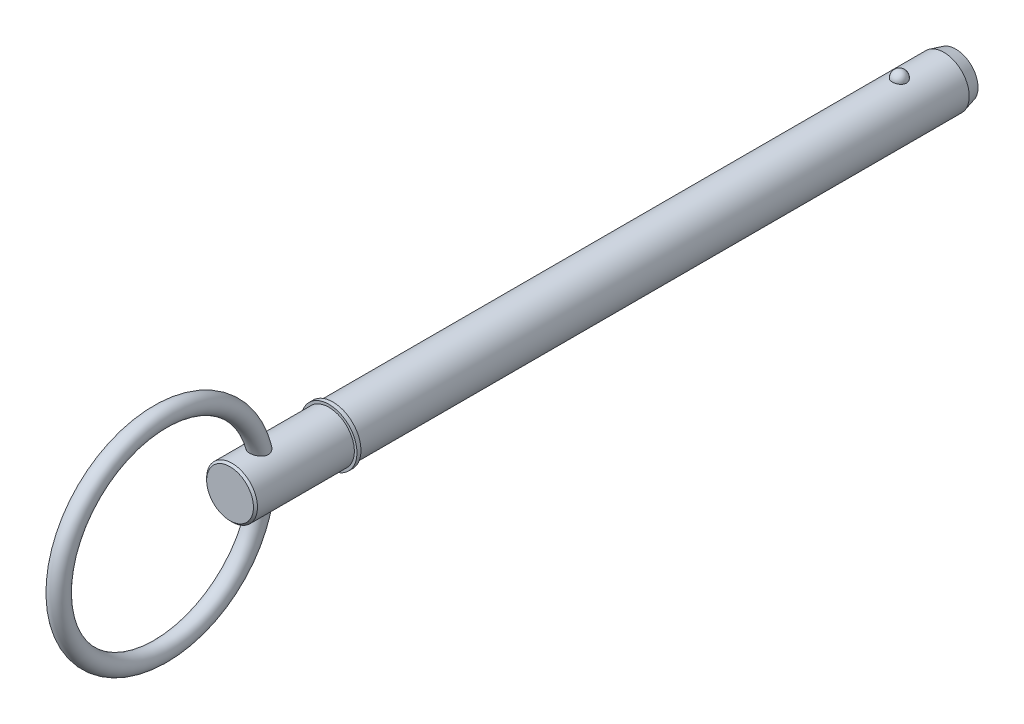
from build123d import *

# Parameters (mm, degrees)
SKETCH2_R           = 6.35
BOSS_EXTRUDE1_DEPTH = 139.7
BOSS_EXTRUDE2_START = 15.88
SKETCH3_R           = 6.35
BOSS_EXTRUDE2_DEPTH = 15.88
CHAMFER1_SIZE       = 3
CHAMFER1_SIZE2      = 0.803847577
SKETCH20_W          = 1
SKETCH20_H          = 7
SKETCH21_R          = 6.35
BOSS_EXTRUDE3_DEPTH = 25.7
CHAMFER2_SIZE       = 0.5
SKETCH24_R          = 2.25


with BuildPart() as part:
    # Sketch2 → Boss-Extrude1 (new body)
    with BuildSketch(Plane.XY):
        Circle(SKETCH2_R)
    extrude(amount=BOSS_EXTRUDE1_DEPTH)

    # Sketch3 → Boss-Extrude2 (add)
    with BuildSketch(Plane(origin=(0, 0, 0), x_dir=(-1, 0, 0), z_dir=(0, 0, -1)).offset(BOSS_EXTRUDE2_START)):
        Circle(SKETCH3_R)
    extrude(amount=-BOSS_EXTRUDE2_DEPTH)

    # Chamfer1
    chamfer1_edges = [part.edges().sort_by_distance(p)[0] for p in [
        (6.35, 0, -15.88),
    ]]
    chamfer1_side = [part.faces().sort_by_distance(p)[0] for p in [
        (6.35, 0, -7.94),
    ]]
    chamfer(chamfer1_edges, length=CHAMFER1_SIZE, length2=CHAMFER1_SIZE2, reference=chamfer1_side[0])

    # Sketch18 → Revolve1 (revolve)
    with BuildSketch(Plane(origin=(0, 0, 0), x_dir=(0, 0, -1), z_dir=(1, 0, 0))):
        with BuildLine():
            Line((1.78, 8.13), (1.78, 4.57))
            ThreePointArc((1.78, 4.57), (0, 6.35), (1.78, 8.13))
        make_face()
    revolve(axis=Axis((0, 8.13, -1.78), (0, -1, 0)))

    # Sketch20 → Revolve2 (revolve)
    with BuildSketch(Plane(origin=(0, 0, 0), x_dir=(0, 0, -1), z_dir=(1, 0, 0)), mode=Mode.PRIVATE) as revolve2_sk:
        with Locations((-140.2, 3.5)):
            Rectangle(SKETCH20_W, SKETCH20_H)
    revolve(revolve2_sk.sketch.rotate(Axis((0, 0, 33.728787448), (0, 0, 1)), 90), axis=Axis((0, 0, 33.728787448), (0, 0, 1)))

    # Sketch21 → Boss-Extrude3 (add)
    with BuildSketch(Plane(origin=(0, 0, 139.7), x_dir=(-1, 0, 0), z_dir=(0, 0, -1))):
        Circle(SKETCH21_R)
    extrude(amount=-BOSS_EXTRUDE3_DEPTH)

    # Chamfer2
    chamfer2_edges = [part.edges().sort_by_distance(p)[0] for p in [
        (6.35, 0, 165.4),
    ]]
    chamfer(chamfer2_edges, length=CHAMFER2_SIZE)

    # Sweep1: sweep along a path in Sketch23
    with BuildLine(Plane(origin=(0, 0, 0), x_dir=(0, 0, -1), z_dir=(1, 0, 0))) as sweep1_path:
        CenterArc((-182.8, 0), 25.4, 0, 360)
    # Sketch24 → Sweep1 (sweep)
    with BuildSketch(Plane(origin=(0, 0, 0), x_dir=(1, 0, 0), z_dir=(0, 1, 0))):
        with Locations((0, -157.4)):
            Circle(SKETCH24_R)
    sweep(path=sweep1_path.line)


solid = part.part
